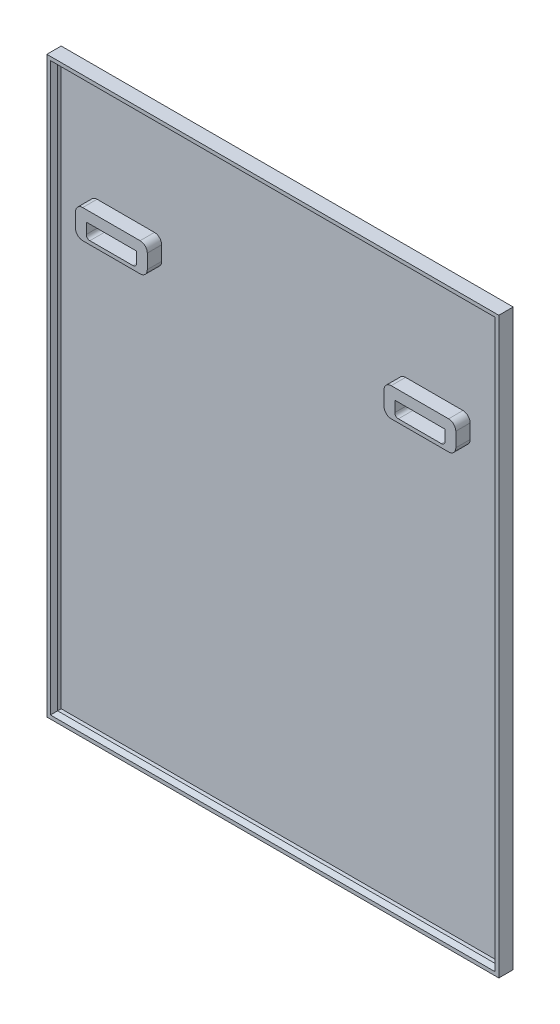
ISO-10303-21;
HEADER;
FILE_DESCRIPTION(('STEP AP214'),'2;1');
FILE_NAME('part.step','',(''),(''),'','','');
FILE_SCHEMA(('AUTOMOTIVE_DESIGN { 1 0 10303 214 1 1 1 1 }'));
ENDSEC;
DATA;
#1=APPLICATION_CONTEXT('core data for automotive mechanical design processes');
#2=APPLICATION_PROTOCOL_DEFINITION('international standard','automotive_design',2000,#1);
#3=PRODUCT_CONTEXT('',#1,'mechanical');
#4=PRODUCT('Part','Part','',(#3));
#5=PRODUCT_RELATED_PRODUCT_CATEGORY('part','',(#4));
#6=PRODUCT_DEFINITION_FORMATION('','',#4);
#7=PRODUCT_DEFINITION_CONTEXT('part definition',#1,'design');
#8=PRODUCT_DEFINITION('design','',#6,#7);
#9=PRODUCT_DEFINITION_SHAPE('','',#8);
#10=(LENGTH_UNIT() NAMED_UNIT(*) SI_UNIT(.MILLI.,.METRE.));
#11=(NAMED_UNIT(*) PLANE_ANGLE_UNIT() SI_UNIT($,.RADIAN.));
#12=(NAMED_UNIT(*) SI_UNIT($,.STERADIAN.) SOLID_ANGLE_UNIT());
#13=UNCERTAINTY_MEASURE_WITH_UNIT(LENGTH_MEASURE(1.E-05),#10,'distance_accuracy_value','');
#14=(GEOMETRIC_REPRESENTATION_CONTEXT(3) GLOBAL_UNCERTAINTY_ASSIGNED_CONTEXT((#13)) GLOBAL_UNIT_ASSIGNED_CONTEXT((#10,
#11,#12)) REPRESENTATION_CONTEXT('',''));
#15=CARTESIAN_POINT('',(0.,0.,0.));
#16=DIRECTION('',(0.,0.,1.));
#17=DIRECTION('',(1.,0.,0.));
#18=AXIS2_PLACEMENT_3D('',#15,#16,#17);
#19=CARTESIAN_POINT('',(0.,-800.,10.));
#20=DIRECTION('',(0.,0.,1.));
#21=DIRECTION('',(1.,0.,0.));
#22=AXIS2_PLACEMENT_3D('',#19,#20,#21);
#23=PLANE('',#22);
#24=DIRECTION('',(0.,1.,0.));
#25=VECTOR('',#24,1.);
#26=CARTESIAN_POINT('',(150.,-160.,10.));
#27=LINE('',#26,#25);
#28=CARTESIAN_POINT('',(150.,-180.,10.));
#29=VERTEX_POINT('',#28);
#30=CARTESIAN_POINT('',(150.,-160.,10.));
#31=VERTEX_POINT('',#30);
#32=EDGE_CURVE('E480',#29,#31,#27,.T.);
#33=ORIENTED_EDGE('',*,*,#32,.F.);
#34=CARTESIAN_POINT('',(140.,-180.,10.));
#35=DIRECTION('',(0.,0.,1.));
#36=DIRECTION('',(-1.,0.,0.));
#37=AXIS2_PLACEMENT_3D('',#34,#35,#36);
#38=CIRCLE('',#37,9.99999999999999);
#39=CARTESIAN_POINT('',(140.,-190.,10.));
#40=VERTEX_POINT('',#39);
#41=EDGE_CURVE('E458',#40,#29,#38,.T.);
#42=ORIENTED_EDGE('',*,*,#41,.F.);
#43=DIRECTION('',(1.,0.,0.));
#44=VECTOR('',#43,1.);
#45=CARTESIAN_POINT('',(60.0000000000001,-190.,10.));
#46=LINE('',#45,#44);
#47=CARTESIAN_POINT('',(60.0000000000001,-190.,10.));
#48=VERTEX_POINT('',#47);
#49=EDGE_CURVE('E463',#48,#40,#46,.T.);
#50=ORIENTED_EDGE('',*,*,#49,.F.);
#51=CARTESIAN_POINT('',(60.0000000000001,-180.,10.));
#52=DIRECTION('',(0.,0.,1.));
#53=DIRECTION('',(1.,0.,0.));
#54=AXIS2_PLACEMENT_3D('',#51,#52,#53);
#55=CIRCLE('',#54,10.);
#56=CARTESIAN_POINT('',(50.,-180.,10.));
#57=VERTEX_POINT('',#56);
#58=EDGE_CURVE('E490',#57,#48,#55,.T.);
#59=ORIENTED_EDGE('',*,*,#58,.F.);
#60=DIRECTION('',(0.,-1.,0.));
#61=VECTOR('',#60,1.);
#62=CARTESIAN_POINT('',(50.,-160.,10.));
#63=LINE('',#62,#61);
#64=CARTESIAN_POINT('',(50.0000000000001,-160.,10.));
#65=VERTEX_POINT('',#64);
#66=EDGE_CURVE('E488',#65,#57,#63,.T.);
#67=ORIENTED_EDGE('',*,*,#66,.F.);
#68=CARTESIAN_POINT('',(60.0000000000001,-160.,10.));
#69=DIRECTION('',(0.,0.,1.));
#70=DIRECTION('',(1.,0.,0.));
#71=AXIS2_PLACEMENT_3D('',#68,#69,#70);
#72=CIRCLE('',#71,9.99999999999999);
#73=CARTESIAN_POINT('',(60.0000000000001,-150.,10.));
#74=VERTEX_POINT('',#73);
#75=EDGE_CURVE('E486',#74,#65,#72,.T.);
#76=ORIENTED_EDGE('',*,*,#75,.F.);
#77=DIRECTION('',(-1.,0.,0.));
#78=VECTOR('',#77,1.);
#79=CARTESIAN_POINT('',(60.0000000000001,-150.,10.));
#80=LINE('',#79,#78);
#81=CARTESIAN_POINT('',(140.,-150.,10.));
#82=VERTEX_POINT('',#81);
#83=EDGE_CURVE('E484',#82,#74,#80,.T.);
#84=ORIENTED_EDGE('',*,*,#83,.F.);
#85=CARTESIAN_POINT('',(140.,-160.,10.));
#86=DIRECTION('',(0.,0.,1.));
#87=DIRECTION('',(1.,0.,0.));
#88=AXIS2_PLACEMENT_3D('',#85,#86,#87);
#89=CIRCLE('',#88,9.99999999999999);
#90=EDGE_CURVE('E482',#31,#82,#89,.T.);
#91=ORIENTED_EDGE('',*,*,#90,.F.);
#92=EDGE_LOOP('',(#33,#42,#50,#59,#67,#76,#84,#91));
#93=FACE_BOUND('',#92,.T.);
#94=DIRECTION('',(0.,-1.,0.));
#95=VECTOR('',#94,1.);
#96=CARTESIAN_POINT('',(10.,0.,10.));
#97=LINE('',#96,#95);
#98=CARTESIAN_POINT('',(10.,-10.,10.));
#99=VERTEX_POINT('',#98);
#100=CARTESIAN_POINT('',(10.0000000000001,-790.,10.));
#101=VERTEX_POINT('',#100);
#102=EDGE_CURVE('E548',#99,#101,#97,.T.);
#103=ORIENTED_EDGE('',*,*,#102,.T.);
#104=DIRECTION('',(1.,0.,0.));
#105=VECTOR('',#104,1.);
#106=CARTESIAN_POINT('',(0.,-790.,10.));
#107=LINE('',#106,#105);
#108=CARTESIAN_POINT('',(620.,-790.,10.));
#109=VERTEX_POINT('',#108);
#110=EDGE_CURVE('E551',#101,#109,#107,.T.);
#111=ORIENTED_EDGE('',*,*,#110,.T.);
#112=DIRECTION('',(0.,1.,0.));
#113=VECTOR('',#112,1.);
#114=CARTESIAN_POINT('',(620.,0.,10.));
#115=LINE('',#114,#113);
#116=CARTESIAN_POINT('',(620.,-10.,10.));
#117=VERTEX_POINT('',#116);
#118=EDGE_CURVE('E562',#109,#117,#115,.T.);
#119=ORIENTED_EDGE('',*,*,#118,.T.);
#120=DIRECTION('',(-1.,0.,0.));
#121=VECTOR('',#120,1.);
#122=CARTESIAN_POINT('',(0.,-10.,10.));
#123=LINE('',#122,#121);
#124=EDGE_CURVE('E559',#117,#99,#123,.T.);
#125=ORIENTED_EDGE('',*,*,#124,.T.);
#126=EDGE_LOOP('',(#103,#111,#119,#125));
#127=FACE_BOUND('',#126,.T.);
#128=DIRECTION('',(0.,1.,0.));
#129=VECTOR('',#128,1.);
#130=CARTESIAN_POINT('',(580.,-160.,10.));
#131=LINE('',#130,#129);
#132=CARTESIAN_POINT('',(580.,-180.,10.));
#133=VERTEX_POINT('',#132);
#134=CARTESIAN_POINT('',(580.,-160.,10.));
#135=VERTEX_POINT('',#134);
#136=EDGE_CURVE('E423',#133,#135,#131,.T.);
#137=ORIENTED_EDGE('',*,*,#136,.F.);
#138=CARTESIAN_POINT('',(570.,-180.,10.));
#139=DIRECTION('',(0.,0.,1.));
#140=DIRECTION('',(-1.,0.,0.));
#141=AXIS2_PLACEMENT_3D('',#138,#139,#140);
#142=CIRCLE('',#141,10.0000000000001);
#143=CARTESIAN_POINT('',(570.,-190.,10.));
#144=VERTEX_POINT('',#143);
#145=EDGE_CURVE('E392',#144,#133,#142,.T.);
#146=ORIENTED_EDGE('',*,*,#145,.F.);
#147=DIRECTION('',(1.,0.,0.));
#148=VECTOR('',#147,1.);
#149=CARTESIAN_POINT('',(490.,-190.,10.));
#150=LINE('',#149,#148);
#151=CARTESIAN_POINT('',(490.,-190.,10.));
#152=VERTEX_POINT('',#151);
#153=EDGE_CURVE('E406',#152,#144,#150,.T.);
#154=ORIENTED_EDGE('',*,*,#153,.F.);
#155=CARTESIAN_POINT('',(490.,-180.,10.));
#156=DIRECTION('',(0.,0.,1.));
#157=DIRECTION('',(1.,0.,0.));
#158=AXIS2_PLACEMENT_3D('',#155,#156,#157);
#159=CIRCLE('',#158,10.);
#160=CARTESIAN_POINT('',(480.,-180.,10.));
#161=VERTEX_POINT('',#160);
#162=EDGE_CURVE('E433',#161,#152,#159,.T.);
#163=ORIENTED_EDGE('',*,*,#162,.F.);
#164=DIRECTION('',(0.,-1.,0.));
#165=VECTOR('',#164,1.);
#166=CARTESIAN_POINT('',(480.,-160.,10.));
#167=LINE('',#166,#165);
#168=CARTESIAN_POINT('',(480.,-160.,10.));
#169=VERTEX_POINT('',#168);
#170=EDGE_CURVE('E431',#169,#161,#167,.T.);
#171=ORIENTED_EDGE('',*,*,#170,.F.);
#172=CARTESIAN_POINT('',(490.,-160.,10.));
#173=DIRECTION('',(0.,0.,1.));
#174=DIRECTION('',(-1.,0.,0.));
#175=AXIS2_PLACEMENT_3D('',#172,#173,#174);
#176=CIRCLE('',#175,10.);
#177=CARTESIAN_POINT('',(490.,-150.,10.));
#178=VERTEX_POINT('',#177);
#179=EDGE_CURVE('E429',#178,#169,#176,.T.);
#180=ORIENTED_EDGE('',*,*,#179,.F.);
#181=DIRECTION('',(-1.,0.,0.));
#182=VECTOR('',#181,1.);
#183=CARTESIAN_POINT('',(490.,-150.,10.));
#184=LINE('',#183,#182);
#185=CARTESIAN_POINT('',(570.,-150.,10.));
#186=VERTEX_POINT('',#185);
#187=EDGE_CURVE('E427',#186,#178,#184,.T.);
#188=ORIENTED_EDGE('',*,*,#187,.F.);
#189=CARTESIAN_POINT('',(570.,-160.,10.));
#190=DIRECTION('',(0.,0.,1.));
#191=DIRECTION('',(1.,0.,0.));
#192=AXIS2_PLACEMENT_3D('',#189,#190,#191);
#193=CIRCLE('',#192,10.);
#194=EDGE_CURVE('E425',#135,#186,#193,.T.);
#195=ORIENTED_EDGE('',*,*,#194,.F.);
#196=EDGE_LOOP('',(#137,#146,#154,#163,#171,#180,#188,#195));
#197=FACE_BOUND('',#196,.T.);
#198=ADVANCED_FACE('F31',(#93,#127,#197),#23,.T.);
#199=CARTESIAN_POINT('',(0.,0.,20.));
#200=DIRECTION('',(1.,0.,0.));
#201=DIRECTION('',(0.,1.,0.));
#202=AXIS2_PLACEMENT_3D('',#199,#200,#201);
#203=PLANE('',#202);
#204=DIRECTION('',(0.,-1.,0.));
#205=VECTOR('',#204,1.);
#206=CARTESIAN_POINT('',(0.,0.,0.));
#207=LINE('',#206,#205);
#208=CARTESIAN_POINT('',(0.,0.,0.));
#209=VERTEX_POINT('',#208);
#210=CARTESIAN_POINT('',(0.,-800.,0.));
#211=VERTEX_POINT('',#210);
#212=EDGE_CURVE('E554',#209,#211,#207,.T.);
#213=ORIENTED_EDGE('',*,*,#212,.T.);
#214=DIRECTION('',(0.,0.,-1.));
#215=VECTOR('',#214,1.);
#216=CARTESIAN_POINT('',(0.,-800.,20.));
#217=LINE('',#216,#215);
#218=CARTESIAN_POINT('',(0.,-800.,20.));
#219=VERTEX_POINT('',#218);
#220=EDGE_CURVE('E595',#219,#211,#217,.T.);
#221=ORIENTED_EDGE('',*,*,#220,.F.);
#222=DIRECTION('',(0.,-1.,0.));
#223=VECTOR('',#222,1.);
#224=CARTESIAN_POINT('',(0.,0.,20.));
#225=LINE('',#224,#223);
#226=CARTESIAN_POINT('',(0.,0.,20.));
#227=VERTEX_POINT('',#226);
#228=EDGE_CURVE('E569',#227,#219,#225,.T.);
#229=ORIENTED_EDGE('',*,*,#228,.F.);
#230=DIRECTION('',(0.,0.,-1.));
#231=VECTOR('',#230,1.);
#232=CARTESIAN_POINT('',(0.,0.,20.));
#233=LINE('',#232,#231);
#234=EDGE_CURVE('E579',#227,#209,#233,.T.);
#235=ORIENTED_EDGE('',*,*,#234,.T.);
#236=EDGE_LOOP('',(#213,#221,#229,#235));
#237=FACE_BOUND('',#236,.T.);
#238=ADVANCED_FACE('F668',(#237),#203,.F.);
#239=CARTESIAN_POINT('',(0.,-800.,20.));
#240=DIRECTION('',(0.,1.,0.));
#241=DIRECTION('',(0.,0.,1.));
#242=AXIS2_PLACEMENT_3D('',#239,#240,#241);
#243=PLANE('',#242);
#244=DIRECTION('',(1.,0.,0.));
#245=VECTOR('',#244,1.);
#246=CARTESIAN_POINT('',(0.,-800.,0.));
#247=LINE('',#246,#245);
#248=CARTESIAN_POINT('',(630.,-800.,0.));
#249=VERTEX_POINT('',#248);
#250=EDGE_CURVE('E582',#211,#249,#247,.T.);
#251=ORIENTED_EDGE('',*,*,#250,.T.);
#252=DIRECTION('',(0.,0.,-1.));
#253=VECTOR('',#252,1.);
#254=CARTESIAN_POINT('',(630.,-800.,20.));
#255=LINE('',#254,#253);
#256=CARTESIAN_POINT('',(630.,-800.,20.));
#257=VERTEX_POINT('',#256);
#258=EDGE_CURVE('E592',#257,#249,#255,.T.);
#259=ORIENTED_EDGE('',*,*,#258,.F.);
#260=DIRECTION('',(1.,0.,0.));
#261=VECTOR('',#260,1.);
#262=CARTESIAN_POINT('',(0.,-800.,20.));
#263=LINE('',#262,#261);
#264=EDGE_CURVE('E572',#219,#257,#263,.T.);
#265=ORIENTED_EDGE('',*,*,#264,.F.);
#266=ORIENTED_EDGE('',*,*,#220,.T.);
#267=EDGE_LOOP('',(#251,#259,#265,#266));
#268=FACE_BOUND('',#267,.T.);
#269=ADVANCED_FACE('F674',(#268),#243,.F.);
#270=CARTESIAN_POINT('',(630.,0.,20.));
#271=DIRECTION('',(-1.,0.,0.));
#272=DIRECTION('',(0.,0.,1.));
#273=AXIS2_PLACEMENT_3D('',#270,#271,#272);
#274=PLANE('',#273);
#275=DIRECTION('',(0.,1.,0.));
#276=VECTOR('',#275,1.);
#277=CARTESIAN_POINT('',(630.,0.,0.));
#278=LINE('',#277,#276);
#279=CARTESIAN_POINT('',(630.,0.,0.));
#280=VERTEX_POINT('',#279);
#281=EDGE_CURVE('E584',#249,#280,#278,.T.);
#282=ORIENTED_EDGE('',*,*,#281,.T.);
#283=DIRECTION('',(0.,0.,-1.));
#284=VECTOR('',#283,1.);
#285=CARTESIAN_POINT('',(630.,0.,20.));
#286=LINE('',#285,#284);
#287=CARTESIAN_POINT('',(630.,0.,20.));
#288=VERTEX_POINT('',#287);
#289=EDGE_CURVE('E589',#288,#280,#286,.T.);
#290=ORIENTED_EDGE('',*,*,#289,.F.);
#291=DIRECTION('',(0.,1.,0.));
#292=VECTOR('',#291,1.);
#293=CARTESIAN_POINT('',(630.,0.,20.));
#294=LINE('',#293,#292);
#295=EDGE_CURVE('E575',#257,#288,#294,.T.);
#296=ORIENTED_EDGE('',*,*,#295,.F.);
#297=ORIENTED_EDGE('',*,*,#258,.T.);
#298=EDGE_LOOP('',(#282,#290,#296,#297));
#299=FACE_BOUND('',#298,.T.);
#300=ADVANCED_FACE('F688',(#299),#274,.F.);
#301=CARTESIAN_POINT('',(0.,0.,20.));
#302=DIRECTION('',(0.,-1.,0.));
#303=DIRECTION('',(0.,0.,-1.));
#304=AXIS2_PLACEMENT_3D('',#301,#302,#303);
#305=PLANE('',#304);
#306=DIRECTION('',(-1.,0.,0.));
#307=VECTOR('',#306,1.);
#308=CARTESIAN_POINT('',(0.,0.,0.));
#309=LINE('',#308,#307);
#310=EDGE_CURVE('E573',#280,#209,#309,.T.);
#311=ORIENTED_EDGE('',*,*,#310,.T.);
#312=ORIENTED_EDGE('',*,*,#234,.F.);
#313=DIRECTION('',(-1.,0.,0.));
#314=VECTOR('',#313,1.);
#315=CARTESIAN_POINT('',(0.,0.,20.));
#316=LINE('',#315,#314);
#317=EDGE_CURVE('E577',#288,#227,#316,.T.);
#318=ORIENTED_EDGE('',*,*,#317,.F.);
#319=ORIENTED_EDGE('',*,*,#289,.T.);
#320=EDGE_LOOP('',(#311,#312,#318,#319));
#321=FACE_BOUND('',#320,.T.);
#322=ADVANCED_FACE('F682',(#321),#305,.F.);
#323=CARTESIAN_POINT('',(0.,-800.,20.));
#324=DIRECTION('',(0.,0.,1.));
#325=DIRECTION('',(1.,0.,0.));
#326=AXIS2_PLACEMENT_3D('',#323,#324,#325);
#327=PLANE('',#326);
#328=DIRECTION('',(1.,0.,0.));
#329=VECTOR('',#328,1.);
#330=CARTESIAN_POINT('',(0.,-5.,20.));
#331=LINE('',#330,#329);
#332=CARTESIAN_POINT('',(5.,-5.,20.));
#333=VERTEX_POINT('',#332);
#334=CARTESIAN_POINT('',(625.,-5.,20.));
#335=VERTEX_POINT('',#334);
#336=EDGE_CURVE('E601',#333,#335,#331,.T.);
#337=ORIENTED_EDGE('',*,*,#336,.T.);
#338=DIRECTION('',(0.,-1.,0.));
#339=VECTOR('',#338,1.);
#340=CARTESIAN_POINT('',(625.,-800.,20.));
#341=LINE('',#340,#339);
#342=CARTESIAN_POINT('',(625.,-795.,20.));
#343=VERTEX_POINT('',#342);
#344=EDGE_CURVE('E607',#335,#343,#341,.T.);
#345=ORIENTED_EDGE('',*,*,#344,.T.);
#346=DIRECTION('',(-1.,0.,0.));
#347=VECTOR('',#346,1.);
#348=CARTESIAN_POINT('',(0.,-795.,20.));
#349=LINE('',#348,#347);
#350=CARTESIAN_POINT('',(5.00000000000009,-795.,20.));
#351=VERTEX_POINT('',#350);
#352=EDGE_CURVE('E605',#343,#351,#349,.T.);
#353=ORIENTED_EDGE('',*,*,#352,.T.);
#354=DIRECTION('',(0.,1.,0.));
#355=VECTOR('',#354,1.);
#356=CARTESIAN_POINT('',(5.0000000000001,-800.,20.));
#357=LINE('',#356,#355);
#358=EDGE_CURVE('E603',#351,#333,#357,.T.);
#359=ORIENTED_EDGE('',*,*,#358,.T.);
#360=EDGE_LOOP('',(#337,#345,#353,#359));
#361=FACE_BOUND('',#360,.T.);
#362=ORIENTED_EDGE('',*,*,#228,.T.);
#363=ORIENTED_EDGE('',*,*,#264,.T.);
#364=ORIENTED_EDGE('',*,*,#295,.T.);
#365=ORIENTED_EDGE('',*,*,#317,.T.);
#366=EDGE_LOOP('',(#362,#363,#364,#365));
#367=FACE_BOUND('',#366,.T.);
#368=ADVANCED_FACE('F632',(#361,#367),#327,.T.);
#369=CARTESIAN_POINT('',(0.,-800.,0.));
#370=DIRECTION('',(0.,0.,1.));
#371=DIRECTION('',(1.,0.,0.));
#372=AXIS2_PLACEMENT_3D('',#369,#370,#371);
#373=PLANE('',#372);
#374=DIRECTION('',(-1.,0.,0.));
#375=VECTOR('',#374,1.);
#376=CARTESIAN_POINT('',(0.,-10.,0.));
#377=LINE('',#376,#375);
#378=CARTESIAN_POINT('',(620.,-10.,0.));
#379=VERTEX_POINT('',#378);
#380=CARTESIAN_POINT('',(10.,-10.,0.));
#381=VERTEX_POINT('',#380);
#382=EDGE_CURVE('E523',#379,#381,#377,.T.);
#383=ORIENTED_EDGE('',*,*,#382,.T.);
#384=DIRECTION('',(0.,-1.,0.));
#385=VECTOR('',#384,1.);
#386=CARTESIAN_POINT('',(10.,0.,0.));
#387=LINE('',#386,#385);
#388=CARTESIAN_POINT('',(10.0000000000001,-790.,0.));
#389=VERTEX_POINT('',#388);
#390=EDGE_CURVE('E527',#381,#389,#387,.T.);
#391=ORIENTED_EDGE('',*,*,#390,.T.);
#392=DIRECTION('',(1.,0.,0.));
#393=VECTOR('',#392,1.);
#394=CARTESIAN_POINT('',(0.,-790.,0.));
#395=LINE('',#394,#393);
#396=CARTESIAN_POINT('',(620.,-790.,0.));
#397=VERTEX_POINT('',#396);
#398=EDGE_CURVE('E530',#389,#397,#395,.T.);
#399=ORIENTED_EDGE('',*,*,#398,.T.);
#400=DIRECTION('',(0.,1.,0.));
#401=VECTOR('',#400,1.);
#402=CARTESIAN_POINT('',(620.,0.,0.));
#403=LINE('',#402,#401);
#404=EDGE_CURVE('E533',#397,#379,#403,.T.);
#405=ORIENTED_EDGE('',*,*,#404,.T.);
#406=EDGE_LOOP('',(#383,#391,#399,#405));
#407=FACE_BOUND('',#406,.T.);
#408=ORIENTED_EDGE('',*,*,#212,.F.);
#409=ORIENTED_EDGE('',*,*,#310,.F.);
#410=ORIENTED_EDGE('',*,*,#281,.F.);
#411=ORIENTED_EDGE('',*,*,#250,.F.);
#412=EDGE_LOOP('',(#408,#409,#410,#411));
#413=FACE_BOUND('',#412,.T.);
#414=ADVANCED_FACE('F665',(#407,#413),#373,.F.);
#415=CARTESIAN_POINT('',(10.,0.,20.));
#416=DIRECTION('',(1.,0.,0.));
#417=DIRECTION('',(0.,1.,0.));
#418=AXIS2_PLACEMENT_3D('',#415,#416,#417);
#419=PLANE('',#418);
#420=DIRECTION('',(0.,0.,-1.));
#421=VECTOR('',#420,1.);
#422=CARTESIAN_POINT('',(10.,-10.,20.));
#423=LINE('',#422,#421);
#424=CARTESIAN_POINT('',(10.,-10.,15.));
#425=VERTEX_POINT('',#424);
#426=EDGE_CURVE('E556',#425,#99,#423,.T.);
#427=ORIENTED_EDGE('',*,*,#426,.F.);
#428=DIRECTION('',(0.,-1.,0.));
#429=VECTOR('',#428,1.);
#430=CARTESIAN_POINT('',(10.,0.,15.));
#431=LINE('',#430,#429);
#432=CARTESIAN_POINT('',(10.0000000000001,-790.,15.));
#433=VERTEX_POINT('',#432);
#434=EDGE_CURVE('E40',#425,#433,#431,.T.);
#435=ORIENTED_EDGE('',*,*,#434,.T.);
#436=DIRECTION('',(0.,0.,-1.));
#437=VECTOR('',#436,1.);
#438=CARTESIAN_POINT('',(10.0000000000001,-790.,20.));
#439=LINE('',#438,#437);
#440=EDGE_CURVE('E552',#433,#101,#439,.T.);
#441=ORIENTED_EDGE('',*,*,#440,.T.);
#442=ORIENTED_EDGE('',*,*,#102,.F.);
#443=EDGE_LOOP('',(#427,#435,#441,#442));
#444=FACE_BOUND('',#443,.T.);
#445=ADVANCED_FACE('F653',(#444),#419,.T.);
#446=CARTESIAN_POINT('',(0.,-790.,20.));
#447=DIRECTION('',(0.,1.,0.));
#448=DIRECTION('',(0.,0.,1.));
#449=AXIS2_PLACEMENT_3D('',#446,#447,#448);
#450=PLANE('',#449);
#451=ORIENTED_EDGE('',*,*,#440,.F.);
#452=DIRECTION('',(1.,0.,0.));
#453=VECTOR('',#452,1.);
#454=CARTESIAN_POINT('',(0.,-790.,15.));
#455=LINE('',#454,#453);
#456=CARTESIAN_POINT('',(620.,-790.,15.));
#457=VERTEX_POINT('',#456);
#458=EDGE_CURVE('E610',#433,#457,#455,.T.);
#459=ORIENTED_EDGE('',*,*,#458,.T.);
#460=DIRECTION('',(0.,0.,-1.));
#461=VECTOR('',#460,1.);
#462=CARTESIAN_POINT('',(620.,-790.,20.));
#463=LINE('',#462,#461);
#464=EDGE_CURVE('E555',#457,#109,#463,.T.);
#465=ORIENTED_EDGE('',*,*,#464,.T.);
#466=ORIENTED_EDGE('',*,*,#110,.F.);
#467=EDGE_LOOP('',(#451,#459,#465,#466));
#468=FACE_BOUND('',#467,.T.);
#469=ADVANCED_FACE('F657',(#468),#450,.T.);
#470=CARTESIAN_POINT('',(620.,0.,20.));
#471=DIRECTION('',(-1.,0.,0.));
#472=DIRECTION('',(0.,0.,1.));
#473=AXIS2_PLACEMENT_3D('',#470,#471,#472);
#474=PLANE('',#473);
#475=ORIENTED_EDGE('',*,*,#464,.F.);
#476=DIRECTION('',(0.,1.,0.));
#477=VECTOR('',#476,1.);
#478=CARTESIAN_POINT('',(620.,0.,15.));
#479=LINE('',#478,#477);
#480=CARTESIAN_POINT('',(620.,-10.,15.));
#481=VERTEX_POINT('',#480);
#482=EDGE_CURVE('E598',#457,#481,#479,.T.);
#483=ORIENTED_EDGE('',*,*,#482,.T.);
#484=DIRECTION('',(0.,0.,-1.));
#485=VECTOR('',#484,1.);
#486=CARTESIAN_POINT('',(620.,-10.,20.));
#487=LINE('',#486,#485);
#488=EDGE_CURVE('E558',#481,#117,#487,.T.);
#489=ORIENTED_EDGE('',*,*,#488,.T.);
#490=ORIENTED_EDGE('',*,*,#118,.F.);
#491=EDGE_LOOP('',(#475,#483,#489,#490));
#492=FACE_BOUND('',#491,.T.);
#493=ADVANCED_FACE('F645',(#492),#474,.T.);
#494=CARTESIAN_POINT('',(0.,-10.,20.));
#495=DIRECTION('',(0.,-1.,0.));
#496=DIRECTION('',(0.,0.,-1.));
#497=AXIS2_PLACEMENT_3D('',#494,#495,#496);
#498=PLANE('',#497);
#499=ORIENTED_EDGE('',*,*,#488,.F.);
#500=DIRECTION('',(-1.,0.,0.));
#501=VECTOR('',#500,1.);
#502=CARTESIAN_POINT('',(0.,-10.,15.));
#503=LINE('',#502,#501);
#504=EDGE_CURVE('E11',#481,#425,#503,.T.);
#505=ORIENTED_EDGE('',*,*,#504,.T.);
#506=ORIENTED_EDGE('',*,*,#426,.T.);
#507=ORIENTED_EDGE('',*,*,#124,.F.);
#508=EDGE_LOOP('',(#499,#505,#506,#507));
#509=FACE_BOUND('',#508,.T.);
#510=ADVANCED_FACE('F648',(#509),#498,.T.);
#511=CARTESIAN_POINT('',(0.,-800.,2.));
#512=DIRECTION('',(0.,0.,1.));
#513=DIRECTION('',(1.,0.,0.));
#514=AXIS2_PLACEMENT_3D('',#511,#512,#513);
#515=PLANE('',#514);
#516=DIRECTION('',(0.,1.,0.));
#517=VECTOR('',#516,1.);
#518=CARTESIAN_POINT('',(620.,0.,2.));
#519=LINE('',#518,#517);
#520=CARTESIAN_POINT('',(620.,-790.,2.));
#521=VERTEX_POINT('',#520);
#522=CARTESIAN_POINT('',(620.,-10.,2.));
#523=VERTEX_POINT('',#522);
#524=EDGE_CURVE('E543',#521,#523,#519,.T.);
#525=ORIENTED_EDGE('',*,*,#524,.F.);
#526=DIRECTION('',(1.,0.,0.));
#527=VECTOR('',#526,1.);
#528=CARTESIAN_POINT('',(0.,-790.,2.));
#529=LINE('',#528,#527);
#530=CARTESIAN_POINT('',(10.0000000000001,-790.,2.));
#531=VERTEX_POINT('',#530);
#532=EDGE_CURVE('E540',#531,#521,#529,.T.);
#533=ORIENTED_EDGE('',*,*,#532,.F.);
#534=DIRECTION('',(0.,-1.,0.));
#535=VECTOR('',#534,1.);
#536=CARTESIAN_POINT('',(10.,0.,2.));
#537=LINE('',#536,#535);
#538=CARTESIAN_POINT('',(10.,-10.,2.));
#539=VERTEX_POINT('',#538);
#540=EDGE_CURVE('E518',#539,#531,#537,.T.);
#541=ORIENTED_EDGE('',*,*,#540,.F.);
#542=DIRECTION('',(-1.,0.,0.));
#543=VECTOR('',#542,1.);
#544=CARTESIAN_POINT('',(0.,-10.,2.));
#545=LINE('',#544,#543);
#546=EDGE_CURVE('E546',#523,#539,#545,.T.);
#547=ORIENTED_EDGE('',*,*,#546,.F.);
#548=EDGE_LOOP('',(#525,#533,#541,#547));
#549=FACE_BOUND('',#548,.T.);
#550=ADVANCED_FACE('F719',(#549),#515,.F.);
#551=CARTESIAN_POINT('',(10.,0.,20.));
#552=DIRECTION('',(1.,0.,0.));
#553=DIRECTION('',(0.,1.,0.));
#554=AXIS2_PLACEMENT_3D('',#551,#552,#553);
#555=PLANE('',#554);
#556=ORIENTED_EDGE('',*,*,#540,.T.);
#557=DIRECTION('',(0.,0.,-1.));
#558=VECTOR('',#557,1.);
#559=CARTESIAN_POINT('',(10.0000000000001,-790.,20.));
#560=LINE('',#559,#558);
#561=EDGE_CURVE('E516',#531,#389,#560,.T.);
#562=ORIENTED_EDGE('',*,*,#561,.T.);
#563=ORIENTED_EDGE('',*,*,#390,.F.);
#564=DIRECTION('',(0.,0.,-1.));
#565=VECTOR('',#564,1.);
#566=CARTESIAN_POINT('',(10.,-10.,20.));
#567=LINE('',#566,#565);
#568=EDGE_CURVE('E520',#539,#381,#567,.T.);
#569=ORIENTED_EDGE('',*,*,#568,.F.);
#570=EDGE_LOOP('',(#556,#562,#563,#569));
#571=FACE_BOUND('',#570,.T.);
#572=ADVANCED_FACE('F721',(#571),#555,.T.);
#573=CARTESIAN_POINT('',(0.,-790.,20.));
#574=DIRECTION('',(0.,1.,0.));
#575=DIRECTION('',(0.,0.,1.));
#576=AXIS2_PLACEMENT_3D('',#573,#574,#575);
#577=PLANE('',#576);
#578=ORIENTED_EDGE('',*,*,#532,.T.);
#579=DIRECTION('',(0.,0.,-1.));
#580=VECTOR('',#579,1.);
#581=CARTESIAN_POINT('',(620.,-790.,20.));
#582=LINE('',#581,#580);
#583=EDGE_CURVE('E519',#521,#397,#582,.T.);
#584=ORIENTED_EDGE('',*,*,#583,.T.);
#585=ORIENTED_EDGE('',*,*,#398,.F.);
#586=ORIENTED_EDGE('',*,*,#561,.F.);
#587=EDGE_LOOP('',(#578,#584,#585,#586));
#588=FACE_BOUND('',#587,.T.);
#589=ADVANCED_FACE('F714',(#588),#577,.T.);
#590=CARTESIAN_POINT('',(620.,0.,20.));
#591=DIRECTION('',(-1.,0.,0.));
#592=DIRECTION('',(0.,0.,1.));
#593=AXIS2_PLACEMENT_3D('',#590,#591,#592);
#594=PLANE('',#593);
#595=ORIENTED_EDGE('',*,*,#524,.T.);
#596=DIRECTION('',(0.,0.,-1.));
#597=VECTOR('',#596,1.);
#598=CARTESIAN_POINT('',(620.,-10.,20.));
#599=LINE('',#598,#597);
#600=EDGE_CURVE('E522',#523,#379,#599,.T.);
#601=ORIENTED_EDGE('',*,*,#600,.T.);
#602=ORIENTED_EDGE('',*,*,#404,.F.);
#603=ORIENTED_EDGE('',*,*,#583,.F.);
#604=EDGE_LOOP('',(#595,#601,#602,#603));
#605=FACE_BOUND('',#604,.T.);
#606=ADVANCED_FACE('F708',(#605),#594,.T.);
#607=CARTESIAN_POINT('',(0.,-10.,20.));
#608=DIRECTION('',(0.,-1.,0.));
#609=DIRECTION('',(0.,0.,-1.));
#610=AXIS2_PLACEMENT_3D('',#607,#608,#609);
#611=PLANE('',#610);
#612=ORIENTED_EDGE('',*,*,#546,.T.);
#613=ORIENTED_EDGE('',*,*,#568,.T.);
#614=ORIENTED_EDGE('',*,*,#382,.F.);
#615=ORIENTED_EDGE('',*,*,#600,.F.);
#616=EDGE_LOOP('',(#612,#613,#614,#615));
#617=FACE_BOUND('',#616,.T.);
#618=ADVANCED_FACE('F704',(#617),#611,.T.);
#619=CARTESIAN_POINT('',(10.,0.,15.));
#620=DIRECTION('',(-0.707106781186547,0.,-0.707106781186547));
#621=DIRECTION('',(-0.707106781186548,0.,0.707106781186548));
#622=AXIS2_PLACEMENT_3D('',#619,#620,#621);
#623=PLANE('',#622);
#624=DIRECTION('',(0.577350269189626,-0.577350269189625,-0.577350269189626));
#625=VECTOR('',#624,1.);
#626=CARTESIAN_POINT('',(6.66666666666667,-6.66666666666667,18.3333333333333));
#627=LINE('',#626,#625);
#628=EDGE_CURVE('E615',#333,#425,#627,.T.);
#629=ORIENTED_EDGE('',*,*,#628,.F.);
#630=ORIENTED_EDGE('',*,*,#358,.F.);
#631=DIRECTION('',(0.577350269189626,0.577350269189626,-0.577350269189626));
#632=VECTOR('',#631,1.);
#633=CARTESIAN_POINT('',(6.66666666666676,-793.333333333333,18.3333333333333));
#634=LINE('',#633,#632);
#635=EDGE_CURVE('E35',#433,#351,#634,.F.);
#636=ORIENTED_EDGE('',*,*,#635,.F.);
#637=ORIENTED_EDGE('',*,*,#434,.F.);
#638=EDGE_LOOP('',(#629,#630,#636,#637));
#639=FACE_BOUND('',#638,.T.);
#640=ADVANCED_FACE('F33',(#639),#623,.F.);
#641=CARTESIAN_POINT('',(0.,-790.,15.));
#642=DIRECTION('',(0.,-0.707106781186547,-0.707106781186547));
#643=DIRECTION('',(0.,0.707106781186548,-0.707106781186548));
#644=AXIS2_PLACEMENT_3D('',#641,#642,#643);
#645=PLANE('',#644);
#646=ORIENTED_EDGE('',*,*,#635,.T.);
#647=ORIENTED_EDGE('',*,*,#352,.F.);
#648=DIRECTION('',(-0.577350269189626,0.577350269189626,-0.577350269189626));
#649=VECTOR('',#648,1.);
#650=CARTESIAN_POINT('',(356.666666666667,-526.666666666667,-248.333333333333));
#651=LINE('',#650,#649);
#652=EDGE_CURVE('E614',#457,#343,#651,.F.);
#653=ORIENTED_EDGE('',*,*,#652,.F.);
#654=ORIENTED_EDGE('',*,*,#458,.F.);
#655=EDGE_LOOP('',(#646,#647,#653,#654));
#656=FACE_BOUND('',#655,.T.);
#657=ADVANCED_FACE('F626',(#656),#645,.F.);
#658=CARTESIAN_POINT('',(0.,-10.,15.));
#659=DIRECTION('',(0.,0.707106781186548,-0.707106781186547));
#660=DIRECTION('',(0.,0.707106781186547,0.707106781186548));
#661=AXIS2_PLACEMENT_3D('',#658,#659,#660);
#662=PLANE('',#661);
#663=ORIENTED_EDGE('',*,*,#628,.T.);
#664=ORIENTED_EDGE('',*,*,#504,.F.);
#665=DIRECTION('',(0.577350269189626,0.577350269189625,0.577350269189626));
#666=VECTOR('',#665,1.);
#667=CARTESIAN_POINT('',(623.333333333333,-6.66666666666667,18.3333333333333));
#668=LINE('',#667,#666);
#669=EDGE_CURVE('E515',#335,#481,#668,.F.);
#670=ORIENTED_EDGE('',*,*,#669,.F.);
#671=ORIENTED_EDGE('',*,*,#336,.F.);
#672=EDGE_LOOP('',(#663,#664,#670,#671));
#673=FACE_BOUND('',#672,.T.);
#674=ADVANCED_FACE('F639',(#673),#662,.F.);
#675=CARTESIAN_POINT('',(620.,0.,15.));
#676=DIRECTION('',(0.707106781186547,0.,-0.707106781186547));
#677=DIRECTION('',(-0.707106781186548,0.,-0.707106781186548));
#678=AXIS2_PLACEMENT_3D('',#675,#676,#677);
#679=PLANE('',#678);
#680=ORIENTED_EDGE('',*,*,#652,.T.);
#681=ORIENTED_EDGE('',*,*,#344,.F.);
#682=ORIENTED_EDGE('',*,*,#669,.T.);
#683=ORIENTED_EDGE('',*,*,#482,.F.);
#684=EDGE_LOOP('',(#680,#681,#682,#683));
#685=FACE_BOUND('',#684,.T.);
#686=ADVANCED_FACE('F637',(#685),#679,.F.);
#687=CARTESIAN_POINT('',(140.,-180.,30.));
#688=DIRECTION('',(0.,0.,-1.));
#689=DIRECTION('',(-1.,0.,0.));
#690=AXIS2_PLACEMENT_3D('',#687,#688,#689);
#691=CYLINDRICAL_SURFACE('',#690,9.99999999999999);
#692=ORIENTED_EDGE('',*,*,#41,.T.);
#693=DIRECTION('',(0.,0.,-1.));
#694=VECTOR('',#693,1.);
#695=CARTESIAN_POINT('',(150.,-180.,30.));
#696=LINE('',#695,#694);
#697=CARTESIAN_POINT('',(150.,-180.,30.));
#698=VERTEX_POINT('',#697);
#699=EDGE_CURVE('E513',#698,#29,#696,.T.);
#700=ORIENTED_EDGE('',*,*,#699,.F.);
#701=CARTESIAN_POINT('',(140.,-180.,30.));
#702=DIRECTION('',(0.,0.,1.));
#703=DIRECTION('',(-1.,0.,0.));
#704=AXIS2_PLACEMENT_3D('',#701,#702,#703);
#705=CIRCLE('',#704,9.99999999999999);
#706=CARTESIAN_POINT('',(140.,-190.,30.));
#707=VERTEX_POINT('',#706);
#708=EDGE_CURVE('E459',#707,#698,#705,.T.);
#709=ORIENTED_EDGE('',*,*,#708,.F.);
#710=DIRECTION('',(0.,0.,-1.));
#711=VECTOR('',#710,1.);
#712=CARTESIAN_POINT('',(140.,-190.,30.));
#713=LINE('',#712,#711);
#714=EDGE_CURVE('E477',#707,#40,#713,.T.);
#715=ORIENTED_EDGE('',*,*,#714,.T.);
#716=EDGE_LOOP('',(#692,#700,#709,#715));
#717=FACE_BOUND('',#716,.T.);
#718=ADVANCED_FACE('F698',(#717),#691,.T.);
#719=CARTESIAN_POINT('',(150.,-160.,30.));
#720=DIRECTION('',(-1.,0.,0.));
#721=DIRECTION('',(0.,0.,1.));
#722=AXIS2_PLACEMENT_3D('',#719,#720,#721);
#723=PLANE('',#722);
#724=ORIENTED_EDGE('',*,*,#32,.T.);
#725=DIRECTION('',(0.,0.,-1.));
#726=VECTOR('',#725,1.);
#727=CARTESIAN_POINT('',(150.,-160.,30.));
#728=LINE('',#727,#726);
#729=CARTESIAN_POINT('',(150.,-160.,30.));
#730=VERTEX_POINT('',#729);
#731=EDGE_CURVE('E510',#730,#31,#728,.T.);
#732=ORIENTED_EDGE('',*,*,#731,.F.);
#733=DIRECTION('',(0.,1.,0.));
#734=VECTOR('',#733,1.);
#735=CARTESIAN_POINT('',(150.,-160.,30.));
#736=LINE('',#735,#734);
#737=EDGE_CURVE('E462',#698,#730,#736,.T.);
#738=ORIENTED_EDGE('',*,*,#737,.F.);
#739=ORIENTED_EDGE('',*,*,#699,.T.);
#740=EDGE_LOOP('',(#724,#732,#738,#739));
#741=FACE_BOUND('',#740,.T.);
#742=ADVANCED_FACE('F755',(#741),#723,.F.);
#743=CARTESIAN_POINT('',(140.,-160.,30.));
#744=DIRECTION('',(0.,0.,-1.));
#745=DIRECTION('',(-1.,0.,0.));
#746=AXIS2_PLACEMENT_3D('',#743,#744,#745);
#747=CYLINDRICAL_SURFACE('',#746,9.99999999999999);
#748=ORIENTED_EDGE('',*,*,#90,.T.);
#749=DIRECTION('',(0.,0.,-1.));
#750=VECTOR('',#749,1.);
#751=CARTESIAN_POINT('',(140.,-150.,30.));
#752=LINE('',#751,#750);
#753=CARTESIAN_POINT('',(140.,-150.,30.));
#754=VERTEX_POINT('',#753);
#755=EDGE_CURVE('E507',#754,#82,#752,.T.);
#756=ORIENTED_EDGE('',*,*,#755,.F.);
#757=CARTESIAN_POINT('',(140.,-160.,30.));
#758=DIRECTION('',(0.,0.,1.));
#759=DIRECTION('',(1.,0.,0.));
#760=AXIS2_PLACEMENT_3D('',#757,#758,#759);
#761=CIRCLE('',#760,9.99999999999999);
#762=EDGE_CURVE('E465',#730,#754,#761,.T.);
#763=ORIENTED_EDGE('',*,*,#762,.F.);
#764=ORIENTED_EDGE('',*,*,#731,.T.);
#765=EDGE_LOOP('',(#748,#756,#763,#764));
#766=FACE_BOUND('',#765,.T.);
#767=ADVANCED_FACE('F759',(#766),#747,.T.);
#768=CARTESIAN_POINT('',(60.0000000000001,-150.,30.));
#769=DIRECTION('',(0.,-1.,0.));
#770=DIRECTION('',(0.,0.,-1.));
#771=AXIS2_PLACEMENT_3D('',#768,#769,#770);
#772=PLANE('',#771);
#773=ORIENTED_EDGE('',*,*,#83,.T.);
#774=DIRECTION('',(0.,0.,-1.));
#775=VECTOR('',#774,1.);
#776=CARTESIAN_POINT('',(60.0000000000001,-150.,30.));
#777=LINE('',#776,#775);
#778=CARTESIAN_POINT('',(60.0000000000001,-150.,30.));
#779=VERTEX_POINT('',#778);
#780=EDGE_CURVE('E504',#779,#74,#777,.T.);
#781=ORIENTED_EDGE('',*,*,#780,.F.);
#782=DIRECTION('',(-1.,0.,0.));
#783=VECTOR('',#782,1.);
#784=CARTESIAN_POINT('',(60.0000000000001,-150.,30.));
#785=LINE('',#784,#783);
#786=EDGE_CURVE('E467',#754,#779,#785,.T.);
#787=ORIENTED_EDGE('',*,*,#786,.F.);
#788=ORIENTED_EDGE('',*,*,#755,.T.);
#789=EDGE_LOOP('',(#773,#781,#787,#788));
#790=FACE_BOUND('',#789,.T.);
#791=ADVANCED_FACE('F763',(#790),#772,.F.);
#792=CARTESIAN_POINT('',(60.0000000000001,-160.,30.));
#793=DIRECTION('',(0.,0.,-1.));
#794=DIRECTION('',(-1.,0.,0.));
#795=AXIS2_PLACEMENT_3D('',#792,#793,#794);
#796=CYLINDRICAL_SURFACE('',#795,9.99999999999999);
#797=ORIENTED_EDGE('',*,*,#75,.T.);
#798=DIRECTION('',(0.,0.,-1.));
#799=VECTOR('',#798,1.);
#800=CARTESIAN_POINT('',(50.0000000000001,-160.,30.));
#801=LINE('',#800,#799);
#802=CARTESIAN_POINT('',(50.0000000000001,-160.,30.));
#803=VERTEX_POINT('',#802);
#804=EDGE_CURVE('E501',#803,#65,#801,.T.);
#805=ORIENTED_EDGE('',*,*,#804,.F.);
#806=CARTESIAN_POINT('',(60.0000000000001,-160.,30.));
#807=DIRECTION('',(0.,0.,1.));
#808=DIRECTION('',(1.,0.,0.));
#809=AXIS2_PLACEMENT_3D('',#806,#807,#808);
#810=CIRCLE('',#809,9.99999999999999);
#811=EDGE_CURVE('E469',#779,#803,#810,.T.);
#812=ORIENTED_EDGE('',*,*,#811,.F.);
#813=ORIENTED_EDGE('',*,*,#780,.T.);
#814=EDGE_LOOP('',(#797,#805,#812,#813));
#815=FACE_BOUND('',#814,.T.);
#816=ADVANCED_FACE('F767',(#815),#796,.T.);
#817=CARTESIAN_POINT('',(50.,-160.,30.));
#818=DIRECTION('',(1.,0.,0.));
#819=DIRECTION('',(0.,0.,-1.));
#820=AXIS2_PLACEMENT_3D('',#817,#818,#819);
#821=PLANE('',#820);
#822=ORIENTED_EDGE('',*,*,#66,.T.);
#823=DIRECTION('',(0.,0.,-1.));
#824=VECTOR('',#823,1.);
#825=CARTESIAN_POINT('',(50.,-180.,30.));
#826=LINE('',#825,#824);
#827=CARTESIAN_POINT('',(50.,-180.,30.));
#828=VERTEX_POINT('',#827);
#829=EDGE_CURVE('E498',#828,#57,#826,.T.);
#830=ORIENTED_EDGE('',*,*,#829,.F.);
#831=DIRECTION('',(0.,-1.,0.));
#832=VECTOR('',#831,1.);
#833=CARTESIAN_POINT('',(50.,-160.,30.));
#834=LINE('',#833,#832);
#835=EDGE_CURVE('E471',#803,#828,#834,.T.);
#836=ORIENTED_EDGE('',*,*,#835,.F.);
#837=ORIENTED_EDGE('',*,*,#804,.T.);
#838=EDGE_LOOP('',(#822,#830,#836,#837));
#839=FACE_BOUND('',#838,.T.);
#840=ADVANCED_FACE('F771',(#839),#821,.F.);
#841=CARTESIAN_POINT('',(60.0000000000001,-180.,30.));
#842=DIRECTION('',(0.,0.,-1.));
#843=DIRECTION('',(-1.,0.,0.));
#844=AXIS2_PLACEMENT_3D('',#841,#842,#843);
#845=CYLINDRICAL_SURFACE('',#844,10.);
#846=ORIENTED_EDGE('',*,*,#58,.T.);
#847=DIRECTION('',(0.,0.,-1.));
#848=VECTOR('',#847,1.);
#849=CARTESIAN_POINT('',(60.0000000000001,-190.,30.));
#850=LINE('',#849,#848);
#851=CARTESIAN_POINT('',(60.0000000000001,-190.,30.));
#852=VERTEX_POINT('',#851);
#853=EDGE_CURVE('E496',#852,#48,#850,.T.);
#854=ORIENTED_EDGE('',*,*,#853,.F.);
#855=CARTESIAN_POINT('',(60.0000000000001,-180.,30.));
#856=DIRECTION('',(0.,0.,1.));
#857=DIRECTION('',(1.,0.,0.));
#858=AXIS2_PLACEMENT_3D('',#855,#856,#857);
#859=CIRCLE('',#858,10.);
#860=EDGE_CURVE('E473',#828,#852,#859,.T.);
#861=ORIENTED_EDGE('',*,*,#860,.F.);
#862=ORIENTED_EDGE('',*,*,#829,.T.);
#863=EDGE_LOOP('',(#846,#854,#861,#862));
#864=FACE_BOUND('',#863,.T.);
#865=ADVANCED_FACE('F775',(#864),#845,.T.);
#866=CARTESIAN_POINT('',(60.0000000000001,-190.,30.));
#867=DIRECTION('',(0.,1.,0.));
#868=DIRECTION('',(-1.,0.,0.));
#869=AXIS2_PLACEMENT_3D('',#866,#867,#868);
#870=PLANE('',#869);
#871=ORIENTED_EDGE('',*,*,#49,.T.);
#872=ORIENTED_EDGE('',*,*,#714,.F.);
#873=DIRECTION('',(1.,0.,0.));
#874=VECTOR('',#873,1.);
#875=CARTESIAN_POINT('',(60.0000000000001,-190.,30.));
#876=LINE('',#875,#874);
#877=EDGE_CURVE('E475',#852,#707,#876,.T.);
#878=ORIENTED_EDGE('',*,*,#877,.F.);
#879=ORIENTED_EDGE('',*,*,#853,.T.);
#880=EDGE_LOOP('',(#871,#872,#878,#879));
#881=FACE_BOUND('',#880,.T.);
#882=ADVANCED_FACE('F779',(#881),#870,.F.);
#883=CARTESIAN_POINT('',(140.,-180.,30.));
#884=DIRECTION('',(0.,0.,-1.));
#885=DIRECTION('',(-1.,0.,0.));
#886=AXIS2_PLACEMENT_3D('',#883,#884,#885);
#887=PLANE('',#886);
#888=CARTESIAN_POINT('',(70.0000000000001,-180.,30.));
#889=DIRECTION('',(0.,0.,1.));
#890=DIRECTION('',(1.,0.,0.));
#891=AXIS2_PLACEMENT_3D('',#888,#889,#890);
#892=CIRCLE('',#891,5.);
#893=CARTESIAN_POINT('',(65.0000000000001,-180.,30.));
#894=VERTEX_POINT('',#893);
#895=CARTESIAN_POINT('',(70.0000000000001,-185.,30.));
#896=VERTEX_POINT('',#895);
#897=EDGE_CURVE('E376',#894,#896,#892,.T.);
#898=ORIENTED_EDGE('',*,*,#897,.F.);
#899=DIRECTION('',(0.,-1.,0.));
#900=VECTOR('',#899,1.);
#901=CARTESIAN_POINT('',(65.0000000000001,-165.,30.));
#902=LINE('',#901,#900);
#903=CARTESIAN_POINT('',(65.0000000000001,-165.,30.));
#904=VERTEX_POINT('',#903);
#905=EDGE_CURVE('E56',#904,#894,#902,.T.);
#906=ORIENTED_EDGE('',*,*,#905,.F.);
#907=DIRECTION('',(-1.,0.,0.));
#908=VECTOR('',#907,1.);
#909=CARTESIAN_POINT('',(65.0000000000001,-165.,30.));
#910=LINE('',#909,#908);
#911=CARTESIAN_POINT('',(135.,-165.,30.));
#912=VERTEX_POINT('',#911);
#913=EDGE_CURVE('E359',#912,#904,#910,.T.);
#914=ORIENTED_EDGE('',*,*,#913,.F.);
#915=DIRECTION('',(0.,1.,0.));
#916=VECTOR('',#915,1.);
#917=CARTESIAN_POINT('',(135.,-165.,30.));
#918=LINE('',#917,#916);
#919=CARTESIAN_POINT('',(135.,-180.,30.));
#920=VERTEX_POINT('',#919);
#921=EDGE_CURVE('E385',#920,#912,#918,.T.);
#922=ORIENTED_EDGE('',*,*,#921,.F.);
#923=CARTESIAN_POINT('',(130.,-180.,30.));
#924=DIRECTION('',(0.,0.,1.));
#925=DIRECTION('',(-1.,0.,0.));
#926=AXIS2_PLACEMENT_3D('',#923,#924,#925);
#927=CIRCLE('',#926,5.);
#928=CARTESIAN_POINT('',(130.,-185.,30.));
#929=VERTEX_POINT('',#928);
#930=EDGE_CURVE('E382',#929,#920,#927,.T.);
#931=ORIENTED_EDGE('',*,*,#930,.F.);
#932=DIRECTION('',(1.,0.,0.));
#933=VECTOR('',#932,1.);
#934=CARTESIAN_POINT('',(70.0000000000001,-185.,30.));
#935=LINE('',#934,#933);
#936=EDGE_CURVE('E379',#896,#929,#935,.T.);
#937=ORIENTED_EDGE('',*,*,#936,.F.);
#938=EDGE_LOOP('',(#898,#906,#914,#922,#931,#937));
#939=FACE_BOUND('',#938,.T.);
#940=ORIENTED_EDGE('',*,*,#708,.T.);
#941=ORIENTED_EDGE('',*,*,#737,.T.);
#942=ORIENTED_EDGE('',*,*,#762,.T.);
#943=ORIENTED_EDGE('',*,*,#786,.T.);
#944=ORIENTED_EDGE('',*,*,#811,.T.);
#945=ORIENTED_EDGE('',*,*,#835,.T.);
#946=ORIENTED_EDGE('',*,*,#860,.T.);
#947=ORIENTED_EDGE('',*,*,#877,.T.);
#948=EDGE_LOOP('',(#940,#941,#942,#943,#944,#945,#946,#947));
#949=FACE_BOUND('',#948,.T.);
#950=ADVANCED_FACE('F783',(#939,#949),#887,.F.);
#951=CARTESIAN_POINT('',(570.,-180.,30.));
#952=DIRECTION('',(0.,0.,-1.));
#953=DIRECTION('',(-1.,0.,0.));
#954=AXIS2_PLACEMENT_3D('',#951,#952,#953);
#955=CYLINDRICAL_SURFACE('',#954,10.0000000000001);
#956=ORIENTED_EDGE('',*,*,#145,.T.);
#957=DIRECTION('',(0.,0.,-1.));
#958=VECTOR('',#957,1.);
#959=CARTESIAN_POINT('',(580.,-180.,30.));
#960=LINE('',#959,#958);
#961=CARTESIAN_POINT('',(580.,-180.,30.));
#962=VERTEX_POINT('',#961);
#963=EDGE_CURVE('E456',#962,#133,#960,.T.);
#964=ORIENTED_EDGE('',*,*,#963,.F.);
#965=CARTESIAN_POINT('',(570.,-180.,30.));
#966=DIRECTION('',(0.,0.,1.));
#967=DIRECTION('',(-1.,0.,0.));
#968=AXIS2_PLACEMENT_3D('',#965,#966,#967);
#969=CIRCLE('',#968,10.0000000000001);
#970=CARTESIAN_POINT('',(570.,-190.,30.));
#971=VERTEX_POINT('',#970);
#972=EDGE_CURVE('E402',#971,#962,#969,.T.);
#973=ORIENTED_EDGE('',*,*,#972,.F.);
#974=DIRECTION('',(0.,0.,-1.));
#975=VECTOR('',#974,1.);
#976=CARTESIAN_POINT('',(570.,-190.,30.));
#977=LINE('',#976,#975);
#978=EDGE_CURVE('E420',#971,#144,#977,.T.);
#979=ORIENTED_EDGE('',*,*,#978,.T.);
#980=EDGE_LOOP('',(#956,#964,#973,#979));
#981=FACE_BOUND('',#980,.T.);
#982=ADVANCED_FACE('F787',(#981),#955,.T.);
#983=CARTESIAN_POINT('',(580.,-160.,30.));
#984=DIRECTION('',(-1.,0.,0.));
#985=DIRECTION('',(0.,-1.,0.));
#986=AXIS2_PLACEMENT_3D('',#983,#984,#985);
#987=PLANE('',#986);
#988=ORIENTED_EDGE('',*,*,#136,.T.);
#989=DIRECTION('',(0.,0.,-1.));
#990=VECTOR('',#989,1.);
#991=CARTESIAN_POINT('',(580.,-160.,30.));
#992=LINE('',#991,#990);
#993=CARTESIAN_POINT('',(580.,-160.,30.));
#994=VERTEX_POINT('',#993);
#995=EDGE_CURVE('E453',#994,#135,#992,.T.);
#996=ORIENTED_EDGE('',*,*,#995,.F.);
#997=DIRECTION('',(0.,1.,0.));
#998=VECTOR('',#997,1.);
#999=CARTESIAN_POINT('',(580.,-160.,30.));
#1000=LINE('',#999,#998);
#1001=EDGE_CURVE('E405',#962,#994,#1000,.T.);
#1002=ORIENTED_EDGE('',*,*,#1001,.F.);
#1003=ORIENTED_EDGE('',*,*,#963,.T.);
#1004=EDGE_LOOP('',(#988,#996,#1002,#1003));
#1005=FACE_BOUND('',#1004,.T.);
#1006=ADVANCED_FACE('F791',(#1005),#987,.F.);
#1007=CARTESIAN_POINT('',(570.,-160.,30.));
#1008=DIRECTION('',(0.,0.,-1.));
#1009=DIRECTION('',(-1.,0.,0.));
#1010=AXIS2_PLACEMENT_3D('',#1007,#1008,#1009);
#1011=CYLINDRICAL_SURFACE('',#1010,10.);
#1012=ORIENTED_EDGE('',*,*,#194,.T.);
#1013=DIRECTION('',(0.,0.,-1.));
#1014=VECTOR('',#1013,1.);
#1015=CARTESIAN_POINT('',(570.,-150.,30.));
#1016=LINE('',#1015,#1014);
#1017=CARTESIAN_POINT('',(570.,-150.,30.));
#1018=VERTEX_POINT('',#1017);
#1019=EDGE_CURVE('E450',#1018,#186,#1016,.T.);
#1020=ORIENTED_EDGE('',*,*,#1019,.F.);
#1021=CARTESIAN_POINT('',(570.,-160.,30.));
#1022=DIRECTION('',(0.,0.,1.));
#1023=DIRECTION('',(1.,0.,0.));
#1024=AXIS2_PLACEMENT_3D('',#1021,#1022,#1023);
#1025=CIRCLE('',#1024,10.);
#1026=EDGE_CURVE('E408',#994,#1018,#1025,.T.);
#1027=ORIENTED_EDGE('',*,*,#1026,.F.);
#1028=ORIENTED_EDGE('',*,*,#995,.T.);
#1029=EDGE_LOOP('',(#1012,#1020,#1027,#1028));
#1030=FACE_BOUND('',#1029,.T.);
#1031=ADVANCED_FACE('F795',(#1030),#1011,.T.);
#1032=CARTESIAN_POINT('',(490.,-150.,30.));
#1033=DIRECTION('',(0.,-1.,0.));
#1034=DIRECTION('',(1.,0.,0.));
#1035=AXIS2_PLACEMENT_3D('',#1032,#1033,#1034);
#1036=PLANE('',#1035);
#1037=ORIENTED_EDGE('',*,*,#187,.T.);
#1038=DIRECTION('',(0.,0.,-1.));
#1039=VECTOR('',#1038,1.);
#1040=CARTESIAN_POINT('',(490.,-150.,30.));
#1041=LINE('',#1040,#1039);
#1042=CARTESIAN_POINT('',(490.,-150.,30.));
#1043=VERTEX_POINT('',#1042);
#1044=EDGE_CURVE('E447',#1043,#178,#1041,.T.);
#1045=ORIENTED_EDGE('',*,*,#1044,.F.);
#1046=DIRECTION('',(-1.,0.,0.));
#1047=VECTOR('',#1046,1.);
#1048=CARTESIAN_POINT('',(490.,-150.,30.));
#1049=LINE('',#1048,#1047);
#1050=EDGE_CURVE('E410',#1018,#1043,#1049,.T.);
#1051=ORIENTED_EDGE('',*,*,#1050,.F.);
#1052=ORIENTED_EDGE('',*,*,#1019,.T.);
#1053=EDGE_LOOP('',(#1037,#1045,#1051,#1052));
#1054=FACE_BOUND('',#1053,.T.);
#1055=ADVANCED_FACE('F799',(#1054),#1036,.F.);
#1056=CARTESIAN_POINT('',(490.,-160.,30.));
#1057=DIRECTION('',(0.,0.,-1.));
#1058=DIRECTION('',(-1.,0.,0.));
#1059=AXIS2_PLACEMENT_3D('',#1056,#1057,#1058);
#1060=CYLINDRICAL_SURFACE('',#1059,10.);
#1061=ORIENTED_EDGE('',*,*,#179,.T.);
#1062=DIRECTION('',(0.,0.,-1.));
#1063=VECTOR('',#1062,1.);
#1064=CARTESIAN_POINT('',(480.,-160.,30.));
#1065=LINE('',#1064,#1063);
#1066=CARTESIAN_POINT('',(480.,-160.,30.));
#1067=VERTEX_POINT('',#1066);
#1068=EDGE_CURVE('E444',#1067,#169,#1065,.T.);
#1069=ORIENTED_EDGE('',*,*,#1068,.F.);
#1070=CARTESIAN_POINT('',(490.,-160.,30.));
#1071=DIRECTION('',(0.,0.,1.));
#1072=DIRECTION('',(-1.,0.,0.));
#1073=AXIS2_PLACEMENT_3D('',#1070,#1071,#1072);
#1074=CIRCLE('',#1073,10.);
#1075=EDGE_CURVE('E412',#1043,#1067,#1074,.T.);
#1076=ORIENTED_EDGE('',*,*,#1075,.F.);
#1077=ORIENTED_EDGE('',*,*,#1044,.T.);
#1078=EDGE_LOOP('',(#1061,#1069,#1076,#1077));
#1079=FACE_BOUND('',#1078,.T.);
#1080=ADVANCED_FACE('F803',(#1079),#1060,.T.);
#1081=CARTESIAN_POINT('',(480.,-160.,30.));
#1082=DIRECTION('',(1.,0.,0.));
#1083=DIRECTION('',(0.,0.,-1.));
#1084=AXIS2_PLACEMENT_3D('',#1081,#1082,#1083);
#1085=PLANE('',#1084);
#1086=ORIENTED_EDGE('',*,*,#170,.T.);
#1087=DIRECTION('',(0.,0.,-1.));
#1088=VECTOR('',#1087,1.);
#1089=CARTESIAN_POINT('',(480.,-180.,30.));
#1090=LINE('',#1089,#1088);
#1091=CARTESIAN_POINT('',(480.,-180.,30.));
#1092=VERTEX_POINT('',#1091);
#1093=EDGE_CURVE('E441',#1092,#161,#1090,.T.);
#1094=ORIENTED_EDGE('',*,*,#1093,.F.);
#1095=DIRECTION('',(0.,-1.,0.));
#1096=VECTOR('',#1095,1.);
#1097=CARTESIAN_POINT('',(480.,-160.,30.));
#1098=LINE('',#1097,#1096);
#1099=EDGE_CURVE('E414',#1067,#1092,#1098,.T.);
#1100=ORIENTED_EDGE('',*,*,#1099,.F.);
#1101=ORIENTED_EDGE('',*,*,#1068,.T.);
#1102=EDGE_LOOP('',(#1086,#1094,#1100,#1101));
#1103=FACE_BOUND('',#1102,.T.);
#1104=ADVANCED_FACE('F807',(#1103),#1085,.F.);
#1105=CARTESIAN_POINT('',(490.,-180.,30.));
#1106=DIRECTION('',(0.,0.,-1.));
#1107=DIRECTION('',(-1.,0.,0.));
#1108=AXIS2_PLACEMENT_3D('',#1105,#1106,#1107);
#1109=CYLINDRICAL_SURFACE('',#1108,10.);
#1110=ORIENTED_EDGE('',*,*,#162,.T.);
#1111=DIRECTION('',(0.,0.,-1.));
#1112=VECTOR('',#1111,1.);
#1113=CARTESIAN_POINT('',(490.,-190.,30.));
#1114=LINE('',#1113,#1112);
#1115=CARTESIAN_POINT('',(490.,-190.,30.));
#1116=VERTEX_POINT('',#1115);
#1117=EDGE_CURVE('E439',#1116,#152,#1114,.T.);
#1118=ORIENTED_EDGE('',*,*,#1117,.F.);
#1119=CARTESIAN_POINT('',(490.,-180.,30.));
#1120=DIRECTION('',(0.,0.,1.));
#1121=DIRECTION('',(1.,0.,0.));
#1122=AXIS2_PLACEMENT_3D('',#1119,#1120,#1121);
#1123=CIRCLE('',#1122,10.);
#1124=EDGE_CURVE('E416',#1092,#1116,#1123,.T.);
#1125=ORIENTED_EDGE('',*,*,#1124,.F.);
#1126=ORIENTED_EDGE('',*,*,#1093,.T.);
#1127=EDGE_LOOP('',(#1110,#1118,#1125,#1126));
#1128=FACE_BOUND('',#1127,.T.);
#1129=ADVANCED_FACE('F811',(#1128),#1109,.T.);
#1130=CARTESIAN_POINT('',(490.,-190.,30.));
#1131=DIRECTION('',(0.,1.,0.));
#1132=DIRECTION('',(0.,0.,1.));
#1133=AXIS2_PLACEMENT_3D('',#1130,#1131,#1132);
#1134=PLANE('',#1133);
#1135=ORIENTED_EDGE('',*,*,#153,.T.);
#1136=ORIENTED_EDGE('',*,*,#978,.F.);
#1137=DIRECTION('',(1.,0.,0.));
#1138=VECTOR('',#1137,1.);
#1139=CARTESIAN_POINT('',(490.,-190.,30.));
#1140=LINE('',#1139,#1138);
#1141=EDGE_CURVE('E418',#1116,#971,#1140,.T.);
#1142=ORIENTED_EDGE('',*,*,#1141,.F.);
#1143=ORIENTED_EDGE('',*,*,#1117,.T.);
#1144=EDGE_LOOP('',(#1135,#1136,#1142,#1143));
#1145=FACE_BOUND('',#1144,.T.);
#1146=ADVANCED_FACE('F815',(#1145),#1134,.F.);
#1147=CARTESIAN_POINT('',(570.,-180.,30.));
#1148=DIRECTION('',(0.,0.,-1.));
#1149=DIRECTION('',(-1.,0.,0.));
#1150=AXIS2_PLACEMENT_3D('',#1147,#1148,#1149);
#1151=PLANE('',#1150);
#1152=CARTESIAN_POINT('',(500.,-180.,30.));
#1153=DIRECTION('',(0.,0.,1.));
#1154=DIRECTION('',(1.,0.,0.));
#1155=AXIS2_PLACEMENT_3D('',#1152,#1153,#1154);
#1156=CIRCLE('',#1155,5.);
#1157=CARTESIAN_POINT('',(495.,-180.,30.));
#1158=VERTEX_POINT('',#1157);
#1159=CARTESIAN_POINT('',(500.,-185.,30.));
#1160=VERTEX_POINT('',#1159);
#1161=EDGE_CURVE('E336',#1158,#1160,#1156,.T.);
#1162=ORIENTED_EDGE('',*,*,#1161,.F.);
#1163=DIRECTION('',(0.,-1.,0.));
#1164=VECTOR('',#1163,1.);
#1165=CARTESIAN_POINT('',(495.,-165.,30.));
#1166=LINE('',#1165,#1164);
#1167=CARTESIAN_POINT('',(495.,-165.,30.));
#1168=VERTEX_POINT('',#1167);
#1169=EDGE_CURVE('E48',#1168,#1158,#1166,.T.);
#1170=ORIENTED_EDGE('',*,*,#1169,.F.);
#1171=DIRECTION('',(-1.,0.,0.));
#1172=VECTOR('',#1171,1.);
#1173=CARTESIAN_POINT('',(495.,-165.,30.));
#1174=LINE('',#1173,#1172);
#1175=CARTESIAN_POINT('',(565.,-165.,30.));
#1176=VERTEX_POINT('',#1175);
#1177=EDGE_CURVE('E322',#1176,#1168,#1174,.T.);
#1178=ORIENTED_EDGE('',*,*,#1177,.F.);
#1179=DIRECTION('',(0.,1.,0.));
#1180=VECTOR('',#1179,1.);
#1181=CARTESIAN_POINT('',(565.,-165.,30.));
#1182=LINE('',#1181,#1180);
#1183=CARTESIAN_POINT('',(565.,-180.,30.));
#1184=VERTEX_POINT('',#1183);
#1185=EDGE_CURVE('E325',#1184,#1176,#1182,.T.);
#1186=ORIENTED_EDGE('',*,*,#1185,.F.);
#1187=CARTESIAN_POINT('',(560.,-180.,30.));
#1188=DIRECTION('',(0.,0.,1.));
#1189=DIRECTION('',(-1.,0.,0.));
#1190=AXIS2_PLACEMENT_3D('',#1187,#1188,#1189);
#1191=CIRCLE('',#1190,5.00000000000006);
#1192=CARTESIAN_POINT('',(560.,-185.,30.));
#1193=VERTEX_POINT('',#1192);
#1194=EDGE_CURVE('E341',#1193,#1184,#1191,.T.);
#1195=ORIENTED_EDGE('',*,*,#1194,.F.);
#1196=DIRECTION('',(1.,0.,0.));
#1197=VECTOR('',#1196,1.);
#1198=CARTESIAN_POINT('',(500.,-185.,30.));
#1199=LINE('',#1198,#1197);
#1200=EDGE_CURVE('E338',#1160,#1193,#1199,.T.);
#1201=ORIENTED_EDGE('',*,*,#1200,.F.);
#1202=EDGE_LOOP('',(#1162,#1170,#1178,#1186,#1195,#1201));
#1203=FACE_BOUND('',#1202,.T.);
#1204=ORIENTED_EDGE('',*,*,#972,.T.);
#1205=ORIENTED_EDGE('',*,*,#1001,.T.);
#1206=ORIENTED_EDGE('',*,*,#1026,.T.);
#1207=ORIENTED_EDGE('',*,*,#1050,.T.);
#1208=ORIENTED_EDGE('',*,*,#1075,.T.);
#1209=ORIENTED_EDGE('',*,*,#1099,.T.);
#1210=ORIENTED_EDGE('',*,*,#1124,.T.);
#1211=ORIENTED_EDGE('',*,*,#1141,.T.);
#1212=EDGE_LOOP('',(#1204,#1205,#1206,#1207,#1208,#1209,#1210,#1211));
#1213=FACE_BOUND('',#1212,.T.);
#1214=ADVANCED_FACE('F819',(#1203,#1213),#1151,.F.);
#1215=CARTESIAN_POINT('',(65.0000000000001,-165.,10.));
#1216=DIRECTION('',(-1.,0.,0.));
#1217=DIRECTION('',(0.,0.,1.));
#1218=AXIS2_PLACEMENT_3D('',#1215,#1216,#1217);
#1219=PLANE('',#1218);
#1220=ORIENTED_EDGE('',*,*,#905,.T.);
#1221=DIRECTION('',(0.,0.,1.));
#1222=VECTOR('',#1221,1.);
#1223=CARTESIAN_POINT('',(65.0000000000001,-180.,10.));
#1224=LINE('',#1223,#1222);
#1225=CARTESIAN_POINT('',(65.0000000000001,-180.,10.));
#1226=VERTEX_POINT('',#1225);
#1227=EDGE_CURVE('E374',#1226,#894,#1224,.T.);
#1228=ORIENTED_EDGE('',*,*,#1227,.F.);
#1229=DIRECTION('',(0.,-1.,0.));
#1230=VECTOR('',#1229,1.);
#1231=CARTESIAN_POINT('',(65.0000000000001,-165.,10.));
#1232=LINE('',#1231,#1230);
#1233=CARTESIAN_POINT('',(65.0000000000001,-165.,10.));
#1234=VERTEX_POINT('',#1233);
#1235=EDGE_CURVE('E355',#1234,#1226,#1232,.T.);
#1236=ORIENTED_EDGE('',*,*,#1235,.F.);
#1237=DIRECTION('',(0.,0.,1.));
#1238=VECTOR('',#1237,1.);
#1239=CARTESIAN_POINT('',(65.0000000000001,-165.,10.));
#1240=LINE('',#1239,#1238);
#1241=EDGE_CURVE('E390',#1234,#904,#1240,.T.);
#1242=ORIENTED_EDGE('',*,*,#1241,.T.);
#1243=EDGE_LOOP('',(#1220,#1228,#1236,#1242));
#1244=FACE_BOUND('',#1243,.T.);
#1245=ADVANCED_FACE('F823',(#1244),#1219,.F.);
#1246=CARTESIAN_POINT('',(65.0000000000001,-165.,10.));
#1247=DIRECTION('',(0.,1.,0.));
#1248=DIRECTION('',(0.,0.,1.));
#1249=AXIS2_PLACEMENT_3D('',#1246,#1247,#1248);
#1250=PLANE('',#1249);
#1251=ORIENTED_EDGE('',*,*,#913,.T.);
#1252=ORIENTED_EDGE('',*,*,#1241,.F.);
#1253=DIRECTION('',(-1.,0.,0.));
#1254=VECTOR('',#1253,1.);
#1255=CARTESIAN_POINT('',(65.0000000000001,-165.,10.));
#1256=LINE('',#1255,#1254);
#1257=CARTESIAN_POINT('',(135.,-165.,10.));
#1258=VERTEX_POINT('',#1257);
#1259=EDGE_CURVE('E371',#1258,#1234,#1256,.T.);
#1260=ORIENTED_EDGE('',*,*,#1259,.F.);
#1261=DIRECTION('',(0.,0.,1.));
#1262=VECTOR('',#1261,1.);
#1263=CARTESIAN_POINT('',(135.,-165.,10.));
#1264=LINE('',#1263,#1262);
#1265=EDGE_CURVE('E393',#1258,#912,#1264,.T.);
#1266=ORIENTED_EDGE('',*,*,#1265,.T.);
#1267=EDGE_LOOP('',(#1251,#1252,#1260,#1266));
#1268=FACE_BOUND('',#1267,.T.);
#1269=ADVANCED_FACE('F827',(#1268),#1250,.F.);
#1270=CARTESIAN_POINT('',(135.,-165.,10.));
#1271=DIRECTION('',(1.,0.,0.));
#1272=DIRECTION('',(0.,1.,0.));
#1273=AXIS2_PLACEMENT_3D('',#1270,#1271,#1272);
#1274=PLANE('',#1273);
#1275=ORIENTED_EDGE('',*,*,#921,.T.);
#1276=ORIENTED_EDGE('',*,*,#1265,.F.);
#1277=DIRECTION('',(0.,1.,0.));
#1278=VECTOR('',#1277,1.);
#1279=CARTESIAN_POINT('',(135.,-165.,10.));
#1280=LINE('',#1279,#1278);
#1281=CARTESIAN_POINT('',(135.,-180.,10.));
#1282=VERTEX_POINT('',#1281);
#1283=EDGE_CURVE('E368',#1282,#1258,#1280,.T.);
#1284=ORIENTED_EDGE('',*,*,#1283,.F.);
#1285=DIRECTION('',(0.,0.,1.));
#1286=VECTOR('',#1285,1.);
#1287=CARTESIAN_POINT('',(135.,-180.,10.));
#1288=LINE('',#1287,#1286);
#1289=EDGE_CURVE('E395',#1282,#920,#1288,.T.);
#1290=ORIENTED_EDGE('',*,*,#1289,.T.);
#1291=EDGE_LOOP('',(#1275,#1276,#1284,#1290));
#1292=FACE_BOUND('',#1291,.T.);
#1293=ADVANCED_FACE('F840',(#1292),#1274,.F.);
#1294=CARTESIAN_POINT('',(130.,-180.,10.));
#1295=DIRECTION('',(0.,0.,1.));
#1296=DIRECTION('',(1.,0.,0.));
#1297=AXIS2_PLACEMENT_3D('',#1294,#1295,#1296);
#1298=CYLINDRICAL_SURFACE('',#1297,5.);
#1299=ORIENTED_EDGE('',*,*,#930,.T.);
#1300=ORIENTED_EDGE('',*,*,#1289,.F.);
#1301=CARTESIAN_POINT('',(130.,-180.,10.));
#1302=DIRECTION('',(0.,0.,1.));
#1303=DIRECTION('',(-1.,0.,0.));
#1304=AXIS2_PLACEMENT_3D('',#1301,#1302,#1303);
#1305=CIRCLE('',#1304,5.);
#1306=CARTESIAN_POINT('',(130.,-185.,10.));
#1307=VERTEX_POINT('',#1306);
#1308=EDGE_CURVE('E365',#1307,#1282,#1305,.T.);
#1309=ORIENTED_EDGE('',*,*,#1308,.F.);
#1310=DIRECTION('',(0.,0.,1.));
#1311=VECTOR('',#1310,1.);
#1312=CARTESIAN_POINT('',(130.,-185.,10.));
#1313=LINE('',#1312,#1311);
#1314=EDGE_CURVE('E397',#1307,#929,#1313,.T.);
#1315=ORIENTED_EDGE('',*,*,#1314,.T.);
#1316=EDGE_LOOP('',(#1299,#1300,#1309,#1315));
#1317=FACE_BOUND('',#1316,.T.);
#1318=ADVANCED_FACE('F836',(#1317),#1298,.F.);
#1319=CARTESIAN_POINT('',(70.0000000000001,-185.,10.));
#1320=DIRECTION('',(0.,-1.,0.));
#1321=DIRECTION('',(0.,0.,-1.));
#1322=AXIS2_PLACEMENT_3D('',#1319,#1320,#1321);
#1323=PLANE('',#1322);
#1324=ORIENTED_EDGE('',*,*,#936,.T.);
#1325=ORIENTED_EDGE('',*,*,#1314,.F.);
#1326=DIRECTION('',(1.,0.,0.));
#1327=VECTOR('',#1326,1.);
#1328=CARTESIAN_POINT('',(70.0000000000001,-185.,10.));
#1329=LINE('',#1328,#1327);
#1330=CARTESIAN_POINT('',(70.0000000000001,-185.,10.));
#1331=VERTEX_POINT('',#1330);
#1332=EDGE_CURVE('E362',#1331,#1307,#1329,.T.);
#1333=ORIENTED_EDGE('',*,*,#1332,.F.);
#1334=DIRECTION('',(0.,0.,1.));
#1335=VECTOR('',#1334,1.);
#1336=CARTESIAN_POINT('',(70.0000000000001,-185.,10.));
#1337=LINE('',#1336,#1335);
#1338=EDGE_CURVE('E399',#1331,#896,#1337,.T.);
#1339=ORIENTED_EDGE('',*,*,#1338,.T.);
#1340=EDGE_LOOP('',(#1324,#1325,#1333,#1339));
#1341=FACE_BOUND('',#1340,.T.);
#1342=ADVANCED_FACE('F832',(#1341),#1323,.F.);
#1343=CARTESIAN_POINT('',(70.0000000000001,-180.,10.));
#1344=DIRECTION('',(0.,0.,1.));
#1345=DIRECTION('',(1.,0.,0.));
#1346=AXIS2_PLACEMENT_3D('',#1343,#1344,#1345);
#1347=CYLINDRICAL_SURFACE('',#1346,5.);
#1348=ORIENTED_EDGE('',*,*,#897,.T.);
#1349=ORIENTED_EDGE('',*,*,#1338,.F.);
#1350=CARTESIAN_POINT('',(70.0000000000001,-180.,10.));
#1351=DIRECTION('',(0.,0.,1.));
#1352=DIRECTION('',(1.,0.,0.));
#1353=AXIS2_PLACEMENT_3D('',#1350,#1351,#1352);
#1354=CIRCLE('',#1353,5.);
#1355=EDGE_CURVE('E358',#1226,#1331,#1354,.T.);
#1356=ORIENTED_EDGE('',*,*,#1355,.F.);
#1357=ORIENTED_EDGE('',*,*,#1227,.T.);
#1358=EDGE_LOOP('',(#1348,#1349,#1356,#1357));
#1359=FACE_BOUND('',#1358,.T.);
#1360=ADVANCED_FACE('F828',(#1359),#1347,.F.);
#1361=CARTESIAN_POINT('',(70.0000000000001,-180.,10.));
#1362=DIRECTION('',(0.,0.,1.));
#1363=DIRECTION('',(1.,0.,0.));
#1364=AXIS2_PLACEMENT_3D('',#1361,#1362,#1363);
#1365=PLANE('',#1364);
#1366=ORIENTED_EDGE('',*,*,#1235,.T.);
#1367=ORIENTED_EDGE('',*,*,#1355,.T.);
#1368=ORIENTED_EDGE('',*,*,#1332,.T.);
#1369=ORIENTED_EDGE('',*,*,#1308,.T.);
#1370=ORIENTED_EDGE('',*,*,#1283,.T.);
#1371=ORIENTED_EDGE('',*,*,#1259,.T.);
#1372=EDGE_LOOP('',(#1366,#1367,#1368,#1369,#1370,#1371));
#1373=FACE_BOUND('',#1372,.T.);
#1374=ADVANCED_FACE('F831',(#1373),#1365,.T.);
#1375=CARTESIAN_POINT('',(495.,-165.,10.));
#1376=DIRECTION('',(-1.,0.,0.));
#1377=DIRECTION('',(0.,0.,1.));
#1378=AXIS2_PLACEMENT_3D('',#1375,#1376,#1377);
#1379=PLANE('',#1378);
#1380=ORIENTED_EDGE('',*,*,#1169,.T.);
#1381=DIRECTION('',(0.,0.,1.));
#1382=VECTOR('',#1381,1.);
#1383=CARTESIAN_POINT('',(495.,-180.,10.));
#1384=LINE('',#1383,#1382);
#1385=CARTESIAN_POINT('',(495.,-180.,10.));
#1386=VERTEX_POINT('',#1385);
#1387=EDGE_CURVE('E299',#1386,#1158,#1384,.T.);
#1388=ORIENTED_EDGE('',*,*,#1387,.F.);
#1389=DIRECTION('',(0.,-1.,0.));
#1390=VECTOR('',#1389,1.);
#1391=CARTESIAN_POINT('',(495.,-165.,10.));
#1392=LINE('',#1391,#1390);
#1393=CARTESIAN_POINT('',(495.,-165.,10.));
#1394=VERTEX_POINT('',#1393);
#1395=EDGE_CURVE('E303',#1394,#1386,#1392,.T.);
#1396=ORIENTED_EDGE('',*,*,#1395,.F.);
#1397=DIRECTION('',(0.,0.,1.));
#1398=VECTOR('',#1397,1.);
#1399=CARTESIAN_POINT('',(495.,-165.,10.));
#1400=LINE('',#1399,#1398);
#1401=EDGE_CURVE('E346',#1394,#1168,#1400,.T.);
#1402=ORIENTED_EDGE('',*,*,#1401,.T.);
#1403=EDGE_LOOP('',(#1380,#1388,#1396,#1402));
#1404=FACE_BOUND('',#1403,.T.);
#1405=ADVANCED_FACE('F301',(#1404),#1379,.F.);
#1406=CARTESIAN_POINT('',(495.,-165.,10.));
#1407=DIRECTION('',(0.,1.,0.));
#1408=DIRECTION('',(0.,0.,1.));
#1409=AXIS2_PLACEMENT_3D('',#1406,#1407,#1408);
#1410=PLANE('',#1409);
#1411=ORIENTED_EDGE('',*,*,#1177,.T.);
#1412=ORIENTED_EDGE('',*,*,#1401,.F.);
#1413=DIRECTION('',(-1.,0.,0.));
#1414=VECTOR('',#1413,1.);
#1415=CARTESIAN_POINT('',(495.,-165.,10.));
#1416=LINE('',#1415,#1414);
#1417=CARTESIAN_POINT('',(565.,-165.,10.));
#1418=VERTEX_POINT('',#1417);
#1419=EDGE_CURVE('E309',#1418,#1394,#1416,.T.);
#1420=ORIENTED_EDGE('',*,*,#1419,.F.);
#1421=DIRECTION('',(0.,0.,1.));
#1422=VECTOR('',#1421,1.);
#1423=CARTESIAN_POINT('',(565.,-165.,10.));
#1424=LINE('',#1423,#1422);
#1425=EDGE_CURVE('E348',#1418,#1176,#1424,.T.);
#1426=ORIENTED_EDGE('',*,*,#1425,.T.);
#1427=EDGE_LOOP('',(#1411,#1412,#1420,#1426));
#1428=FACE_BOUND('',#1427,.T.);
#1429=ADVANCED_FACE('F853',(#1428),#1410,.F.);
#1430=CARTESIAN_POINT('',(565.,-165.,10.));
#1431=DIRECTION('',(1.,0.,0.));
#1432=DIRECTION('',(0.,0.,-1.));
#1433=AXIS2_PLACEMENT_3D('',#1430,#1431,#1432);
#1434=PLANE('',#1433);
#1435=ORIENTED_EDGE('',*,*,#1185,.T.);
#1436=ORIENTED_EDGE('',*,*,#1425,.F.);
#1437=DIRECTION('',(0.,1.,0.));
#1438=VECTOR('',#1437,1.);
#1439=CARTESIAN_POINT('',(565.,-165.,10.));
#1440=LINE('',#1439,#1438);
#1441=CARTESIAN_POINT('',(565.,-180.,10.));
#1442=VERTEX_POINT('',#1441);
#1443=EDGE_CURVE('E332',#1442,#1418,#1440,.T.);
#1444=ORIENTED_EDGE('',*,*,#1443,.F.);
#1445=DIRECTION('',(0.,0.,1.));
#1446=VECTOR('',#1445,1.);
#1447=CARTESIAN_POINT('',(565.,-180.,10.));
#1448=LINE('',#1447,#1446);
#1449=EDGE_CURVE('E350',#1442,#1184,#1448,.T.);
#1450=ORIENTED_EDGE('',*,*,#1449,.T.);
#1451=EDGE_LOOP('',(#1435,#1436,#1444,#1450));
#1452=FACE_BOUND('',#1451,.T.);
#1453=ADVANCED_FACE('F863',(#1452),#1434,.F.);
#1454=CARTESIAN_POINT('',(560.,-180.,10.));
#1455=DIRECTION('',(0.,0.,1.));
#1456=DIRECTION('',(1.,0.,0.));
#1457=AXIS2_PLACEMENT_3D('',#1454,#1455,#1456);
#1458=CYLINDRICAL_SURFACE('',#1457,5.00000000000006);
#1459=ORIENTED_EDGE('',*,*,#1194,.T.);
#1460=ORIENTED_EDGE('',*,*,#1449,.F.);
#1461=CARTESIAN_POINT('',(560.,-180.,10.));
#1462=DIRECTION('',(0.,0.,1.));
#1463=DIRECTION('',(-1.,0.,0.));
#1464=AXIS2_PLACEMENT_3D('',#1461,#1462,#1463);
#1465=CIRCLE('',#1464,5.00000000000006);
#1466=CARTESIAN_POINT('',(560.,-185.,10.));
#1467=VERTEX_POINT('',#1466);
#1468=EDGE_CURVE('E329',#1467,#1442,#1465,.T.);
#1469=ORIENTED_EDGE('',*,*,#1468,.F.);
#1470=DIRECTION('',(0.,0.,1.));
#1471=VECTOR('',#1470,1.);
#1472=CARTESIAN_POINT('',(560.,-185.,10.));
#1473=LINE('',#1472,#1471);
#1474=EDGE_CURVE('E352',#1467,#1193,#1473,.T.);
#1475=ORIENTED_EDGE('',*,*,#1474,.T.);
#1476=EDGE_LOOP('',(#1459,#1460,#1469,#1475));
#1477=FACE_BOUND('',#1476,.T.);
#1478=ADVANCED_FACE('F859',(#1477),#1458,.F.);
#1479=CARTESIAN_POINT('',(500.,-185.,10.));
#1480=DIRECTION('',(0.,-1.,0.));
#1481=DIRECTION('',(0.,0.,-1.));
#1482=AXIS2_PLACEMENT_3D('',#1479,#1480,#1481);
#1483=PLANE('',#1482);
#1484=ORIENTED_EDGE('',*,*,#1200,.T.);
#1485=ORIENTED_EDGE('',*,*,#1474,.F.);
#1486=DIRECTION('',(1.,0.,0.));
#1487=VECTOR('',#1486,1.);
#1488=CARTESIAN_POINT('',(500.,-185.,10.));
#1489=LINE('',#1488,#1487);
#1490=CARTESIAN_POINT('',(500.,-185.,10.));
#1491=VERTEX_POINT('',#1490);
#1492=EDGE_CURVE('E317',#1491,#1467,#1489,.T.);
#1493=ORIENTED_EDGE('',*,*,#1492,.F.);
#1494=DIRECTION('',(0.,0.,1.));
#1495=VECTOR('',#1494,1.);
#1496=CARTESIAN_POINT('',(500.,-185.,10.));
#1497=LINE('',#1496,#1495);
#1498=EDGE_CURVE('E308',#1491,#1160,#1497,.T.);
#1499=ORIENTED_EDGE('',*,*,#1498,.T.);
#1500=EDGE_LOOP('',(#1484,#1485,#1493,#1499));
#1501=FACE_BOUND('',#1500,.T.);
#1502=ADVANCED_FACE('F856',(#1501),#1483,.F.);
#1503=CARTESIAN_POINT('',(500.,-180.,10.));
#1504=DIRECTION('',(0.,0.,1.));
#1505=DIRECTION('',(1.,0.,0.));
#1506=AXIS2_PLACEMENT_3D('',#1503,#1504,#1505);
#1507=CYLINDRICAL_SURFACE('',#1506,5.);
#1508=ORIENTED_EDGE('',*,*,#1161,.T.);
#1509=ORIENTED_EDGE('',*,*,#1498,.F.);
#1510=CARTESIAN_POINT('',(500.,-180.,10.));
#1511=DIRECTION('',(0.,0.,1.));
#1512=DIRECTION('',(1.,0.,0.));
#1513=AXIS2_PLACEMENT_3D('',#1510,#1511,#1512);
#1514=CIRCLE('',#1513,5.);
#1515=EDGE_CURVE('E312',#1386,#1491,#1514,.T.);
#1516=ORIENTED_EDGE('',*,*,#1515,.F.);
#1517=ORIENTED_EDGE('',*,*,#1387,.T.);
#1518=EDGE_LOOP('',(#1508,#1509,#1516,#1517));
#1519=FACE_BOUND('',#1518,.T.);
#1520=ADVANCED_FACE('F313',(#1519),#1507,.F.);
#1521=CARTESIAN_POINT('',(500.,-180.,10.));
#1522=DIRECTION('',(0.,0.,1.));
#1523=DIRECTION('',(1.,0.,0.));
#1524=AXIS2_PLACEMENT_3D('',#1521,#1522,#1523);
#1525=PLANE('',#1524);
#1526=ORIENTED_EDGE('',*,*,#1395,.T.);
#1527=ORIENTED_EDGE('',*,*,#1515,.T.);
#1528=ORIENTED_EDGE('',*,*,#1492,.T.);
#1529=ORIENTED_EDGE('',*,*,#1468,.T.);
#1530=ORIENTED_EDGE('',*,*,#1443,.T.);
#1531=ORIENTED_EDGE('',*,*,#1419,.T.);
#1532=EDGE_LOOP('',(#1526,#1527,#1528,#1529,#1530,#1531));
#1533=FACE_BOUND('',#1532,.T.);
#1534=ADVANCED_FACE('F319',(#1533),#1525,.T.);
#1535=CLOSED_SHELL('',(#198,#238,#269,#300,#322,#368,#414,#445,#469,#493,#510,#550,#572,#589,
#606,#618,#640,#657,#674,#686,#718,#742,#767,#791,#816,#840,#865,#882,#950,#982,#1006,#1031,
#1055,#1080,#1104,#1129,#1146,#1214,#1245,#1269,#1293,#1318,#1342,#1360,#1374,#1405,#1429,#1453,
#1478,#1502,#1520,#1534));
#1536=MANIFOLD_SOLID_BREP('B2',#1535);
#1537=ADVANCED_BREP_SHAPE_REPRESENTATION('',(#18,#1536),#14);
#1538=SHAPE_DEFINITION_REPRESENTATION(#9,#1537);
ENDSEC;
END-ISO-10303-21;
